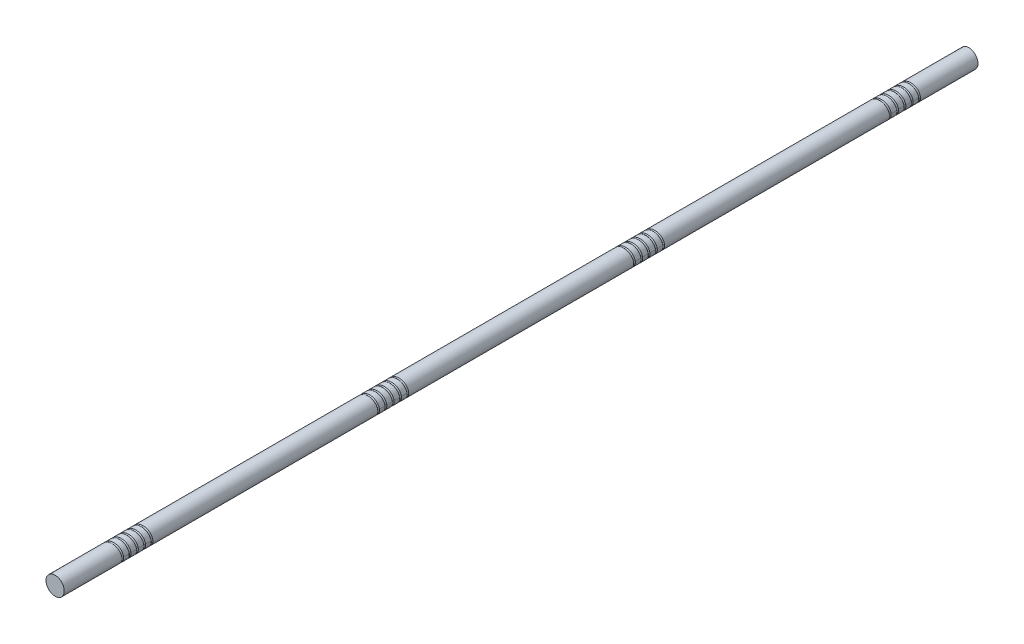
from build123d import *

# Parameters (mm, degrees)
SKETCH1_R              = 25
BOSS_EXTRUDE1_DEPTH    = 2500
CUT_SWEEP1_PITCH       = 20
CUT_SWEEP1_HEIGHT      = 100
CUT_SWEEP1_RADIUS      = 27.116666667
CUT_SWEEP1_START_ANGLE = -180
SKETCH3_R              = 3.175
LPATTERN1_COUNT        = 4
LPATTERN1_PITCH        = 700


with BuildPart() as part:
    # Sketch1 → Boss-Extrude1 (new body)
    with BuildSketch(Plane.XY):
        Circle(SKETCH1_R)
    extrude(amount=BOSS_EXTRUDE1_DEPTH)

    # Cut-Sweep1: sweep along a helix
    with BuildLine() as cut_sweep1_path:
        add(Helix(CUT_SWEEP1_PITCH, CUT_SWEEP1_HEIGHT, CUT_SWEEP1_RADIUS, center=(0, 0, 150), direction=(0, 0, 1), mode=Mode.PRIVATE).rotate(Axis((0, 0, 150), (0, 0, 1)), CUT_SWEEP1_START_ANGLE))
    # Sketch3 → Cut-Sweep1 (sweep, cut)
    with BuildSketch(Plane(origin=(0, 0, 0), x_dir=(1, 0, 0), z_dir=(0, 1, 0))):
        with Locations((-27.116666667, -150)):
            Circle(SKETCH3_R)
    cut_sweep1 = sweep(path=cut_sweep1_path.line, is_frenet=True, mode=Mode.SUBTRACT)

    # LPattern1: Cut-Sweep1 ×4
    with Locations(*[(0, 0, i * LPATTERN1_PITCH) for i in range(1, LPATTERN1_COUNT)]):
        add(cut_sweep1, mode=Mode.SUBTRACT)


solid = part.part
